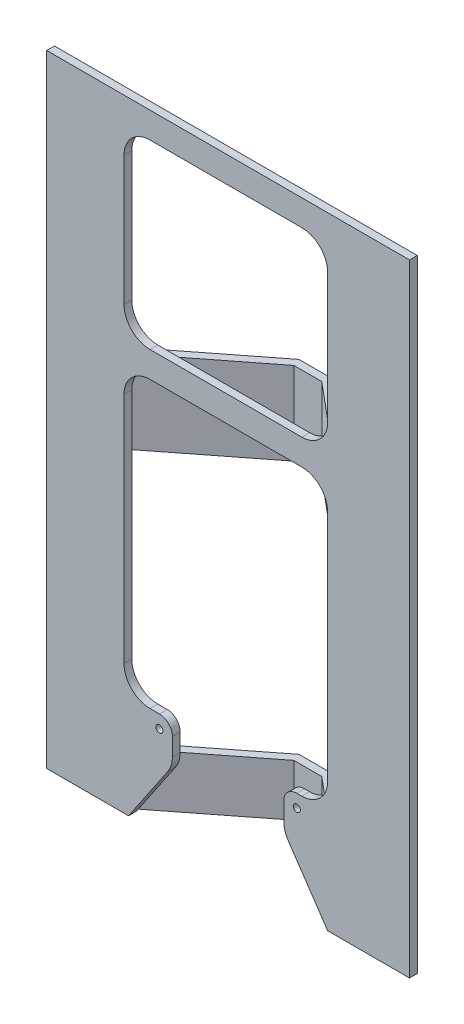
from build123d import *

# Parameters (mm, degrees)
SKETCH1_W             = 177.8
SKETCH1_H             = 304.8
BOSS_EXTRUDE1_DEPTH   = 3.81
BOSS_EXTRUDE3_DEPTH   = 25.4
BOSS_EXTRUDE4_DEPTH   = 40.64
F_8_32_TAPPED_HOLE1_D = 3.4544
CUT_EXTRUDE2_REACH    = 321.843


with BuildPart() as part:
    # Sketch1 → Boss-Extrude1 (new body)
    with BuildSketch(Plane.XY):
        with Locations((0, -152.4)):
            Rectangle(SKETCH1_W, SKETCH1_H)
    extrude(amount=BOSS_EXTRUDE1_DEPTH)

    # Sketch3 → Boss-Extrude3 (add)
    with BuildSketch(Plane.XZ.offset(304.8)):
        Polygon((-62.068465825, 3.81), (-55.88, 3.81), (-6.423447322, -34.829693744), (7.291006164, -34.829693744), (53.34, 3.81), (59.26730778, 3.81), (8.677732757, -38.639693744), (-7.735335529, -38.639693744), align=None)
    extrude(amount=-BOSS_EXTRUDE3_DEPTH)

    # Sketch4 → Boss-Extrude4 (add)
    with BuildSketch(Plane(origin=(0, -111.76, 0), x_dir=(1, 0, 0), z_dir=(0, 1, 0))):
        Polygon((48.799418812, 0), (54.726726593, 0), (8.677732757, 38.639693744), (-7.735335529, 38.639693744), (-57.191888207, 0), (-51.003422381, 0), (-6.423447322, 34.829693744), (7.291006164, 34.829693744), align=None)
    extrude(amount=-BOSS_EXTRUDE4_DEPTH)

    # 8-32 Tapped Hole1 (through all)
    with Locations(Plane.XY.offset(3.81)):
        with Locations((-33.655, -260.35), (33.655, -260.35)):
            Hole(F_8_32_TAPPED_HOLE1_D / 2)

    # Sketch12 → Cut-Extrude2 (cut, up to next)
    with BuildSketch(Plane(origin=(0, 0, 0), x_dir=(-1, 0, 0), z_dir=(0, 0, -1)), mode=Mode.PRIVATE) as cut_extrude2_sk1:
        with BuildLine():
            Line((-27.305, -260.35), (-27.305, -269.155390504))
            ThreePointArc((-27.305, -269.155390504), (-27.863096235, -272.878853), (-29.488334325, -276.275063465))
            Line((-29.488334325, -276.275063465), (-48.799418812, -304.8))
            Line((-48.799418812, -304.8), (48.799418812, -304.8))
            Line((48.799418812, -304.8), (29.488334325, -276.275063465))
            ThreePointArc((29.488334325, -276.275063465), (27.863096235, -272.878853), (27.305, -269.155390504))
            Line((27.305, -269.155390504), (27.305, -260.35))
            ThreePointArc((27.305, -260.35), (29.164871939, -255.859871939), (33.655, -254))
            Line((33.655, -254), (38.303422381, -254))
            ThreePointArc((38.303422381, -254), (47.283678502, -250.280256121), (51.003422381, -241.3))
            Line((51.003422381, -241.3), (51.003422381, -127))
            ThreePointArc((51.003422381, -127), (47.283678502, -118.019743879), (38.303422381, -114.3))
            Line((38.303422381, -114.3), (-36.099418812, -114.3))
            ThreePointArc((-36.099418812, -114.3), (-45.079674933, -118.019743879), (-48.799418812, -127))
            Line((-48.799418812, -127), (-48.799418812, -241.3))
            ThreePointArc((-48.799418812, -241.3), (-45.079674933, -250.280256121), (-36.099418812, -254))
            Line((-36.099418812, -254), (-33.655, -254))
            ThreePointArc((-33.655, -254), (-29.164871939, -255.859871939), (-27.305, -260.35))
        make_face()
    cut_extrude2_tool1 = extrude(cut_extrude2_sk1.sketch, amount=-CUT_EXTRUDE2_REACH, mode=Mode.PRIVATE) & part.part
    # Sketch12 → Cut-Extrude2 (cut, up to next)
    with BuildSketch(Plane(origin=(0, 0, 0), x_dir=(-1, 0, 0), z_dir=(0, 0, -1)), mode=Mode.PRIVATE) as cut_extrude2_sk2:
        with BuildLine():
            Line((-36.099418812, -12.7), (38.303422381, -12.7))
            ThreePointArc((38.303422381, -12.7), (47.283678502, -16.419743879), (51.003422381, -25.4))
            Line((51.003422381, -25.4), (51.003422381, -88.9))
            ThreePointArc((51.003422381, -88.9), (47.283678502, -97.880256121), (38.303422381, -101.6))
            Line((38.303422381, -101.6), (-36.099418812, -101.6))
            ThreePointArc((-36.099418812, -101.6), (-45.079674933, -97.880256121), (-48.799418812, -88.9))
            Line((-48.799418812, -88.9), (-48.799418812, -25.4))
            ThreePointArc((-48.799418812, -25.4), (-45.079674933, -16.419743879), (-36.099418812, -12.7))
        make_face()
    cut_extrude2_tool2 = extrude(cut_extrude2_sk2.sketch, amount=-CUT_EXTRUDE2_REACH, mode=Mode.PRIVATE) & part.part
    add(cut_extrude2_tool1.solids().sort_by_distance((-0.880281, -203.874123, 0))[0], mode=Mode.SUBTRACT)
    add(cut_extrude2_tool2.solids().sort_by_distance((-1.102002, -57.15, 0))[0], mode=Mode.SUBTRACT)


solid = part.part
